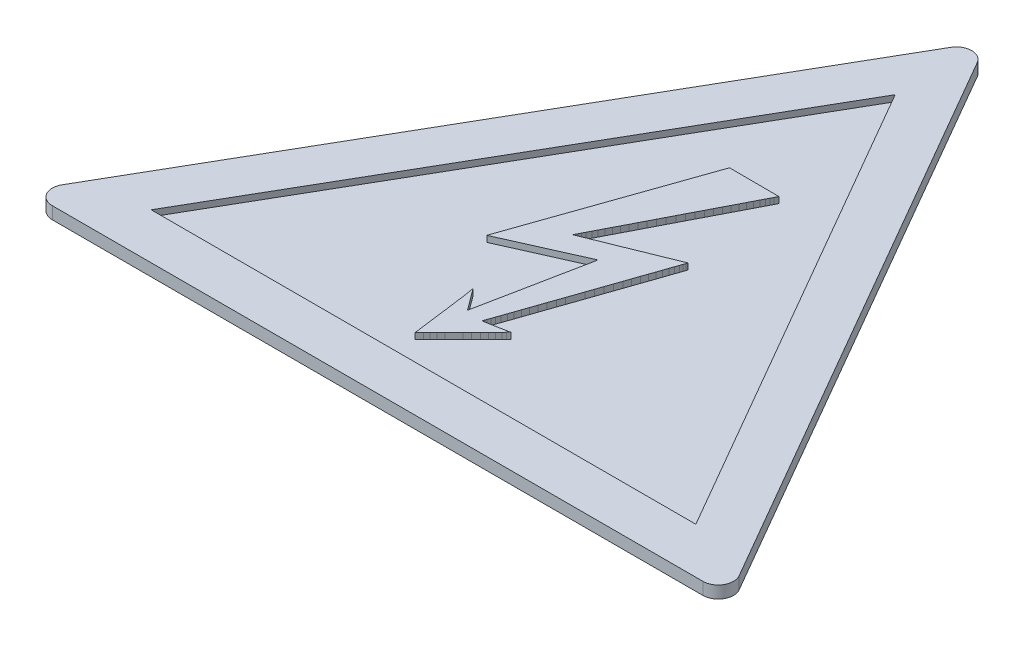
from build123d import *

# Parameters (mm, degrees)
SKIZZE1_W                       = 25
SKIZZE1_H                       = 25
LINEAR_AUSTRAGEN1_DEPTH         = 0.2
LINEAR_AUSTRAGEN_D_NN1_DEPTH    = 0.2
VERRUNDUNG1_R                   = 0.5
LINEAR_AUSTRAGEN2_DEPTH         = 0.2
SKIZZE4_OUTSIDE_W               = 34.072
SKIZZE4_OUTSIDE_H               = 34.072
SCHNITT_LINEAR_AUSTRAGEN1_DEPTH = 0.4


with BuildPart() as part:
    # Skizze1 → Linear austragen1 (new body)
    with BuildSketch(Plane(origin=(0, 0, 0), x_dir=(1, 0, 0), z_dir=(0, 1, 0))):
        with Locations((0, 2.5)):
            Rectangle(SKIZZE1_W, SKIZZE1_H)
    extrude(amount=LINEAR_AUSTRAGEN1_DEPTH)

    # Skizze2 → Linear-Austragen-D_nn1 (add)
    with BuildSketch(Plane(origin=(0, 0.2, 0), x_dir=(-1, 0, 0), z_dir=(0, 1, 0))):
        Polygon((11.5, 6.639528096), (0, -13.279056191), (-11.5, 6.639528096), align=None)
        Polygon((8.901923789, 5.139528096), (0, -10.279056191), (-8.901923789, 5.139528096), align=None, mode=Mode.SUBTRACT)
    extrude(amount=LINEAR_AUSTRAGEN_D_NN1_DEPTH)

    # Verrundung1
    verrundung1_edges = [part.edges().sort_by_distance(p)[0] for p in [
        (11.5, 0.3, 6.639528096),
        (0, 0.3, -13.279056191),
        (-11.5, 0.3, 6.639528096),
    ]]
    fillet(verrundung1_edges, radius=VERRUNDUNG1_R)

    # Skizze3 → Linear austragen2 (add)
    with BuildSketch(Plane(origin=(-0.377843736, 0.2, -0.651577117), x_dir=(1, 0, 0), z_dir=(0, 1, 0))):
        Polygon((-0.260448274, 4.850871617), (-2.317087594, -1.028769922), (0.199670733, 0.092191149), (0.196582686, 0.082927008), (0.190406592, 0.052046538), (0.18114245, 0.002637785), (0.168790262, -0.062211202), (0.153350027, -0.142500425), (0.134821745, -0.235141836), (0.113205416, -0.343223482), (0.08850104, -0.463657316), (0.063796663, -0.593355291), (0.03600424, -0.735405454), (0.00512377, -0.880543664), (-0.0257567, -1.034946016), (-0.056637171, -1.192436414), (-0.090605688, -1.356102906), (-0.121486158, -1.522857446), (-0.155454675, -1.689611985), (-0.189423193, -1.856366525), (-0.220303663, -2.020033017), (-0.25427218, -2.18369951), (-0.285152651, -2.341189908), (-0.316033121, -2.495592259), (-0.346913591, -2.643818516), (-0.374706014, -2.782780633), (-0.399410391, -2.912478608), (-0.424114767, -3.032912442), (-0.445731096, -3.137906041), (-0.464259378, -3.233635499), (-0.479699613, -3.313924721), (-0.492051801, -3.378773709), (-0.501315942, -3.425094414), (-0.507492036, -3.455974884), (-0.510580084, -3.465239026), (-1.038636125, -2.751900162), (-1.035548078, -2.761164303), (-1.029371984, -2.782780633), (-1.02319589, -2.81674915), (-1.017019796, -2.859981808), (-1.007755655, -2.912478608), (-0.998491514, -2.971151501), (-0.989227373, -3.039088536), (-0.976875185, -3.116289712), (-0.964522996, -3.196578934), (-0.955258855, -3.283044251), (-0.942906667, -3.375685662), (-0.927466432, -3.47141512), (-0.915114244, -3.567144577), (-0.902762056, -3.669050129), (-0.887321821, -3.770955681), (-0.874969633, -3.872861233), (-0.862617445, -3.974766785), (-0.850265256, -4.076672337), (-0.834825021, -4.175489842), (-0.822472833, -4.274307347), (-0.810120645, -4.366948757), (-0.800856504, -4.456502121), (-0.788504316, -4.542967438), (-0.779240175, -4.620168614), (-0.769976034, -4.694281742), (-0.760711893, -4.75913073), (-0.751447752, -4.817803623), (-0.745271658, -4.864124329), (-0.74218361, -4.90426894), (-0.736007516, -4.932061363), (-0.732919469, -4.950589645), (-0.732919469, -4.956765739), (-0.717479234, -4.941325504), (-0.668070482, -4.891916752), (-0.590869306, -4.814715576), (-0.492051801, -4.712810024), (-0.374706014, -4.595464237), (-0.245008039, -4.459590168), (-0.102957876, -4.317540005), (0.042180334, -4.172401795), (0.187318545, -4.024175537), (0.326280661, -3.882125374), (0.459066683, -3.746251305), (0.57641247, -3.628905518), (0.675229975, -3.526999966), (0.75243115, -3.446710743), (0.801839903, -3.397301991), (0.820368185, -3.378773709), (0.811104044, -3.381861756), (0.786399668, -3.384949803), (0.746255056, -3.394213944), (0.696846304, -3.403478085), (0.635085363, -3.415830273), (0.570236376, -3.428182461), (0.496123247, -3.443622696), (0.425098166, -3.455974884), (0.350985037, -3.47141512), (0.276871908, -3.483767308), (0.212022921, -3.496119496), (0.15026198, -3.505383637), (0.100853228, -3.514647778), (0.060708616, -3.523911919), (0.03600424, -3.526999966), (0.026740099, -3.526999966), (0.032916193, -3.514647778), (0.045268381, -3.47141512), (0.069972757, -3.403478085), (0.100853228, -3.313924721), (0.140997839, -3.199666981), (0.187318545, -3.066880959), (0.239815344, -2.915566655), (0.298488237, -2.748812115), (0.360249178, -2.563529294), (0.428186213, -2.368982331), (0.499211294, -2.16208318), (0.573324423, -1.945919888), (0.650525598, -1.723580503), (0.730814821, -1.495065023), (0.811104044, -1.260373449), (0.891393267, -1.025681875), (0.971682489, -0.794078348), (1.051971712, -0.559386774), (1.132260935, -0.330871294), (1.20946211, -0.108531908), (1.283575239, 0.107631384), (1.354600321, 0.317618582), (1.422537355, 0.512165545), (1.487386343, 0.694360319), (1.542971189, 0.864202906), (1.595467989, 1.01551721), (1.641788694, 1.151391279), (1.681933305, 1.265649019), (1.712813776, 1.355202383), (1.737518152, 1.423139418), (1.74987034, 1.466372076), (1.756046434, 1.481812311), (1.74987034, 1.478724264), (1.725165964, 1.469460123), (1.688109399, 1.454019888), (1.641788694, 1.432403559), (1.580027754, 1.407699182), (1.509002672, 1.379906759), (1.425625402, 1.345938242), (1.336072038, 1.308881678), (1.237254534, 1.268737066), (1.132260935, 1.225504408), (1.021091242, 1.182271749), (0.906833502, 1.132862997), (0.786399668, 1.086542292), (0.662877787, 1.037133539), (0.536267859, 0.98463674), (0.412745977, 0.935227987), (0.286136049, 0.882731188), (0.162614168, 0.833322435), (0.039092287, 0.783913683), (-0.081341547, 0.734504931), (-0.195599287, 0.688184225), (-0.30676898, 0.644951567), (-0.411762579, 0.601718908), (-0.510580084, 0.561574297), (-0.600133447, 0.52760578), (-0.683510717, 0.493637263), (-0.754535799, 0.465844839), (-0.813208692, 0.441140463), (-0.862617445, 0.419524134), (-0.899674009, 0.407171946), (-0.921290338, 0.397907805), (-0.927466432, 0.394819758), (-0.921290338, 0.407171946), (-0.902762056, 0.44422851), (-0.871881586, 0.502901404), (-0.831736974, 0.586278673), (-0.779240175, 0.685096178), (-0.717479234, 0.805530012), (-0.6495422, 0.938316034), (-0.572341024, 1.089630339), (-0.488963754, 1.250208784), (-0.399410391, 1.426227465), (-0.303680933, 1.608422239), (-0.204863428, 1.802969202), (-0.102957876, 2.000604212), (0.002035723, 2.204415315), (0.107029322, 2.411314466), (0.215110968, 2.618213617), (0.320104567, 2.828200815), (0.428186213, 3.035099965), (0.533179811, 3.235823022), (0.635085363, 3.436546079), (0.733902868, 3.628004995), (0.829632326, 3.813287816), (0.91918569, 3.98621845), (1.00256296, 4.149884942), (1.079764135, 4.298111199), (1.14770117, 4.433985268), (1.20946211, 4.551331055), (1.26195891, 4.653236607), (1.305191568, 4.73352583), (1.336072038, 4.795286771), (1.354600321, 4.832343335), (1.360776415, 4.844695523), align=None)
    extrude(amount=LINEAR_AUSTRAGEN2_DEPTH)

    # Skizze4 outside → Schnitt-Linear austragen1 (cut)
    with BuildSketch(Plane(origin=(0, 0.4, 0), x_dir=(-1, 0, 0), z_dir=(0, 1, 0))):
        with Locations((0, -2.5)):
            Rectangle(SKIZZE4_OUTSIDE_W, SKIZZE4_OUTSIDE_H)
        with BuildLine():
            Line((-11.066987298, 5.889528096), (-0.433012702, -12.529056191))
            ThreePointArc((-0.433012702, -12.529056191), (0, -12.779056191), (0.433012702, -12.529056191))
            Line((0.433012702, -12.529056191), (11.066987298, 5.889528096))
            ThreePointArc((11.066987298, 5.889528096), (11.066987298, 6.389528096), (10.633974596, 6.639528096))
            Line((10.633974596, 6.639528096), (-10.633974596, 6.639528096))
            ThreePointArc((-10.633974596, 6.639528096), (-11.066987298, 6.389528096), (-11.066987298, 5.889528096))
        make_face(mode=Mode.SUBTRACT)
    extrude(amount=-SCHNITT_LINEAR_AUSTRAGEN1_DEPTH, mode=Mode.SUBTRACT)


solid = part.part
